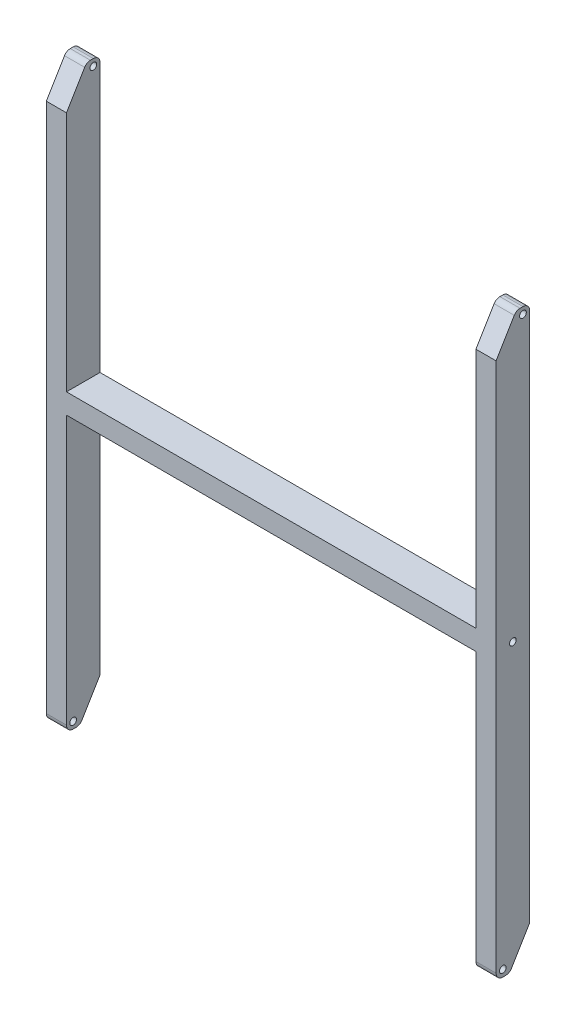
ISO-10303-21;
HEADER;
FILE_DESCRIPTION(('STEP AP214'),'2;1');
FILE_NAME('part.step','',(''),(''),'','','');
FILE_SCHEMA(('AUTOMOTIVE_DESIGN { 1 0 10303 214 1 1 1 1 }'));
ENDSEC;
DATA;
#1=APPLICATION_CONTEXT('core data for automotive mechanical design processes');
#2=APPLICATION_PROTOCOL_DEFINITION('international standard','automotive_design',2000,#1);
#3=PRODUCT_CONTEXT('',#1,'mechanical');
#4=PRODUCT('Part','Part','',(#3));
#5=PRODUCT_RELATED_PRODUCT_CATEGORY('part','',(#4));
#6=PRODUCT_DEFINITION_FORMATION('','',#4);
#7=PRODUCT_DEFINITION_CONTEXT('part definition',#1,'design');
#8=PRODUCT_DEFINITION('design','',#6,#7);
#9=PRODUCT_DEFINITION_SHAPE('','',#8);
#10=(LENGTH_UNIT() NAMED_UNIT(*) SI_UNIT(.MILLI.,.METRE.));
#11=(NAMED_UNIT(*) PLANE_ANGLE_UNIT() SI_UNIT($,.RADIAN.));
#12=(NAMED_UNIT(*) SI_UNIT($,.STERADIAN.) SOLID_ANGLE_UNIT());
#13=UNCERTAINTY_MEASURE_WITH_UNIT(LENGTH_MEASURE(1.E-05),#10,'distance_accuracy_value','');
#14=(GEOMETRIC_REPRESENTATION_CONTEXT(3) GLOBAL_UNCERTAINTY_ASSIGNED_CONTEXT((#13)) GLOBAL_UNIT_ASSIGNED_CONTEXT((#10,
#11,#12)) REPRESENTATION_CONTEXT('',''));
#15=CARTESIAN_POINT('',(0.,0.,0.));
#16=DIRECTION('',(0.,0.,1.));
#17=DIRECTION('',(1.,0.,0.));
#18=AXIS2_PLACEMENT_3D('',#15,#16,#17);
#19=CARTESIAN_POINT('',(0.,30.,50.));
#20=DIRECTION('',(0.,1.,0.));
#21=DIRECTION('',(0.,0.,1.));
#22=AXIS2_PLACEMENT_3D('',#19,#20,#21);
#23=PLANE('',#22);
#24=DIRECTION('',(0.,0.,-1.));
#25=VECTOR('',#24,1.);
#26=CARTESIAN_POINT('',(610.,30.,50.));
#27=LINE('',#26,#25);
#28=CARTESIAN_POINT('',(610.,30.,50.));
#29=VERTEX_POINT('',#28);
#30=CARTESIAN_POINT('',(610.,30.,-50.));
#31=VERTEX_POINT('',#30);
#32=EDGE_CURVE('E244',#29,#31,#27,.T.);
#33=ORIENTED_EDGE('',*,*,#32,.T.);
#34=DIRECTION('',(1.,0.,0.));
#35=VECTOR('',#34,1.);
#36=CARTESIAN_POINT('',(0.,30.,-50.));
#37=LINE('',#36,#35);
#38=CARTESIAN_POINT('',(-610.,30.,-50.));
#39=VERTEX_POINT('',#38);
#40=EDGE_CURVE('E238',#39,#31,#37,.T.);
#41=ORIENTED_EDGE('',*,*,#40,.F.);
#42=DIRECTION('',(0.,0.,-1.));
#43=VECTOR('',#42,1.);
#44=CARTESIAN_POINT('',(-610.,30.,50.));
#45=LINE('',#44,#43);
#46=CARTESIAN_POINT('',(-610.,30.,50.));
#47=VERTEX_POINT('',#46);
#48=EDGE_CURVE('E241',#47,#39,#45,.T.);
#49=ORIENTED_EDGE('',*,*,#48,.F.);
#50=DIRECTION('',(1.,0.,0.));
#51=VECTOR('',#50,1.);
#52=CARTESIAN_POINT('',(0.,30.,50.));
#53=LINE('',#52,#51);
#54=EDGE_CURVE('E402',#47,#29,#53,.T.);
#55=ORIENTED_EDGE('',*,*,#54,.T.);
#56=EDGE_LOOP('',(#33,#41,#49,#55));
#57=FACE_BOUND('',#56,.T.);
#58=ADVANCED_FACE('F41',(#57),#23,.T.);
#59=CARTESIAN_POINT('',(-670.,0.,50.));
#60=DIRECTION('',(1.,0.,0.));
#61=DIRECTION('',(0.,0.,-1.));
#62=AXIS2_PLACEMENT_3D('',#59,#60,#61);
#63=PLANE('',#62);
#64=CARTESIAN_POINT('',(-670.,0.,0.));
#65=DIRECTION('',(1.,0.,0.));
#66=DIRECTION('',(0.,0.,-1.));
#67=AXIS2_PLACEMENT_3D('',#64,#65,#66);
#68=CIRCLE('',#67,10.);
#69=CARTESIAN_POINT('',(-670.,0.,-10.));
#70=VERTEX_POINT('',#69);
#71=EDGE_CURVE('E732',#70,#70,#68,.T.);
#72=ORIENTED_EDGE('',*,*,#71,.T.);
#73=EDGE_LOOP('',(#72));
#74=FACE_BOUND('',#73,.T.);
#75=DIRECTION('',(0.,-0.857492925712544,0.514495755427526));
#76=VECTOR('',#75,1.);
#77=CARTESIAN_POINT('',(-670.,750.,50.));
#78=LINE('',#77,#76);
#79=CARTESIAN_POINT('',(-670.,840.28991510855,-4.17394906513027));
#80=VERTEX_POINT('',#79);
#81=CARTESIAN_POINT('',(-670.,750.,50.));
#82=VERTEX_POINT('',#81);
#83=EDGE_CURVE('E376',#80,#82,#78,.T.);
#84=ORIENTED_EDGE('',*,*,#83,.F.);
#85=CARTESIAN_POINT('',(-670.,830.,-21.3238075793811));
#86=DIRECTION('',(1.,0.,0.));
#87=DIRECTION('',(0.,0.,-1.));
#88=AXIS2_PLACEMENT_3D('',#85,#86,#87);
#89=CIRCLE('',#88,20.);
#90=CARTESIAN_POINT('',(-670.,850.,-21.3238075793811));
#91=VERTEX_POINT('',#90);
#92=EDGE_CURVE('E270',#80,#91,#89,.F.);
#93=ORIENTED_EDGE('',*,*,#92,.T.);
#94=DIRECTION('',(0.,0.,1.));
#95=VECTOR('',#94,1.);
#96=CARTESIAN_POINT('',(-670.,850.,-9.99999999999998));
#97=LINE('',#96,#95);
#98=CARTESIAN_POINT('',(-670.,850.,-30.));
#99=VERTEX_POINT('',#98);
#100=EDGE_CURVE('E373',#99,#91,#97,.T.);
#101=ORIENTED_EDGE('',*,*,#100,.F.);
#102=CARTESIAN_POINT('',(-670.,830.,-30.));
#103=DIRECTION('',(1.,0.,0.));
#104=DIRECTION('',(0.,0.,-1.));
#105=AXIS2_PLACEMENT_3D('',#102,#103,#104);
#106=CIRCLE('',#105,20.);
#107=CARTESIAN_POINT('',(-670.,830.,-50.));
#108=VERTEX_POINT('',#107);
#109=EDGE_CURVE('E268',#99,#108,#106,.F.);
#110=ORIENTED_EDGE('',*,*,#109,.T.);
#111=DIRECTION('',(0.,-1.,0.));
#112=VECTOR('',#111,1.);
#113=CARTESIAN_POINT('',(-670.,0.,-50.));
#114=LINE('',#113,#112);
#115=CARTESIAN_POINT('',(-670.,-750.,-50.));
#116=VERTEX_POINT('',#115);
#117=EDGE_CURVE('E379',#108,#116,#114,.T.);
#118=ORIENTED_EDGE('',*,*,#117,.T.);
#119=DIRECTION('',(0.,0.857492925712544,-0.514495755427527));
#120=VECTOR('',#119,1.);
#121=CARTESIAN_POINT('',(-670.,-850.,9.99999999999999));
#122=LINE('',#121,#120);
#123=CARTESIAN_POINT('',(-670.,-840.289915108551,4.17394906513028));
#124=VERTEX_POINT('',#123);
#125=EDGE_CURVE('E360',#124,#116,#122,.T.);
#126=ORIENTED_EDGE('',*,*,#125,.F.);
#127=CARTESIAN_POINT('',(-670.,-830.,21.3238075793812));
#128=DIRECTION('',(1.,0.,0.));
#129=DIRECTION('',(0.,0.,-1.));
#130=AXIS2_PLACEMENT_3D('',#127,#128,#129);
#131=CIRCLE('',#130,20.);
#132=CARTESIAN_POINT('',(-670.,-850.,21.3238075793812));
#133=VERTEX_POINT('',#132);
#134=EDGE_CURVE('E266',#124,#133,#131,.F.);
#135=ORIENTED_EDGE('',*,*,#134,.T.);
#136=DIRECTION('',(0.,0.,-1.));
#137=VECTOR('',#136,1.);
#138=CARTESIAN_POINT('',(-670.,-850.,50.));
#139=LINE('',#138,#137);
#140=CARTESIAN_POINT('',(-670.,-850.,30.));
#141=VERTEX_POINT('',#140);
#142=EDGE_CURVE('E357',#141,#133,#139,.T.);
#143=ORIENTED_EDGE('',*,*,#142,.F.);
#144=CARTESIAN_POINT('',(-670.,-830.,30.));
#145=DIRECTION('',(1.,0.,0.));
#146=DIRECTION('',(0.,0.,-1.));
#147=AXIS2_PLACEMENT_3D('',#144,#145,#146);
#148=CIRCLE('',#147,20.);
#149=CARTESIAN_POINT('',(-670.,-830.,50.));
#150=VERTEX_POINT('',#149);
#151=EDGE_CURVE('E264',#141,#150,#148,.F.);
#152=ORIENTED_EDGE('',*,*,#151,.T.);
#153=DIRECTION('',(0.,-1.,0.));
#154=VECTOR('',#153,1.);
#155=CARTESIAN_POINT('',(-670.,0.,50.));
#156=LINE('',#155,#154);
#157=EDGE_CURVE('E386',#82,#150,#156,.T.);
#158=ORIENTED_EDGE('',*,*,#157,.F.);
#159=EDGE_LOOP('',(#84,#93,#101,#110,#118,#126,#135,#143,#152,#158));
#160=FACE_BOUND('',#159,.T.);
#161=CARTESIAN_POINT('',(-670.,830.,-30.));
#162=DIRECTION('',(1.,0.,0.));
#163=DIRECTION('',(0.,0.,-1.));
#164=AXIS2_PLACEMENT_3D('',#161,#162,#163);
#165=CIRCLE('',#164,10.);
#166=CARTESIAN_POINT('',(-670.,830.,-40.));
#167=VERTEX_POINT('',#166);
#168=EDGE_CURVE('E367',#167,#167,#165,.T.);
#169=ORIENTED_EDGE('',*,*,#168,.T.);
#170=EDGE_LOOP('',(#169));
#171=FACE_BOUND('',#170,.T.);
#172=CARTESIAN_POINT('',(-670.,-830.,30.));
#173=DIRECTION('',(1.,0.,0.));
#174=DIRECTION('',(0.,0.,-1.));
#175=AXIS2_PLACEMENT_3D('',#172,#173,#174);
#176=CIRCLE('',#175,10.);
#177=CARTESIAN_POINT('',(-670.,-830.,20.));
#178=VERTEX_POINT('',#177);
#179=EDGE_CURVE('E351',#178,#178,#176,.T.);
#180=ORIENTED_EDGE('',*,*,#179,.T.);
#181=EDGE_LOOP('',(#180));
#182=FACE_BOUND('',#181,.T.);
#183=ADVANCED_FACE('F434',(#74,#160,#171,#182),#63,.F.);
#184=CARTESIAN_POINT('',(-610.,0.,50.));
#185=DIRECTION('',(1.,0.,0.));
#186=DIRECTION('',(0.,1.,0.));
#187=AXIS2_PLACEMENT_3D('',#184,#185,#186);
#188=PLANE('',#187);
#189=DIRECTION('',(0.,0.,-1.));
#190=VECTOR('',#189,1.);
#191=CARTESIAN_POINT('',(-610.,-850.,50.));
#192=LINE('',#191,#190);
#193=CARTESIAN_POINT('',(-610.,-850.,30.));
#194=VERTEX_POINT('',#193);
#195=CARTESIAN_POINT('',(-610.,-850.,21.3238075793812));
#196=VERTEX_POINT('',#195);
#197=EDGE_CURVE('E354',#194,#196,#192,.T.);
#198=ORIENTED_EDGE('',*,*,#197,.T.);
#199=CARTESIAN_POINT('',(-610.,-830.,21.3238075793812));
#200=DIRECTION('',(1.,0.,0.));
#201=DIRECTION('',(0.,1.,0.));
#202=AXIS2_PLACEMENT_3D('',#199,#200,#201);
#203=CIRCLE('',#202,20.);
#204=CARTESIAN_POINT('',(-610.,-840.289915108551,4.17394906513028));
#205=VERTEX_POINT('',#204);
#206=EDGE_CURVE('E282',#196,#205,#203,.T.);
#207=ORIENTED_EDGE('',*,*,#206,.T.);
#208=DIRECTION('',(0.,0.857492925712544,-0.514495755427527));
#209=VECTOR('',#208,1.);
#210=CARTESIAN_POINT('',(-610.,-850.,9.99999999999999));
#211=LINE('',#210,#209);
#212=CARTESIAN_POINT('',(-610.,-750.,-50.));
#213=VERTEX_POINT('',#212);
#214=EDGE_CURVE('E361',#205,#213,#211,.T.);
#215=ORIENTED_EDGE('',*,*,#214,.T.);
#216=DIRECTION('',(0.,-1.,0.));
#217=VECTOR('',#216,1.);
#218=CARTESIAN_POINT('',(-610.,0.,-50.));
#219=LINE('',#218,#217);
#220=CARTESIAN_POINT('',(-610.,-30.,-50.));
#221=VERTEX_POINT('',#220);
#222=EDGE_CURVE('E409',#221,#213,#219,.T.);
#223=ORIENTED_EDGE('',*,*,#222,.F.);
#224=DIRECTION('',(0.,0.,-1.));
#225=VECTOR('',#224,1.);
#226=CARTESIAN_POINT('',(-610.,-30.,50.));
#227=LINE('',#226,#225);
#228=CARTESIAN_POINT('',(-610.,-30.,50.));
#229=VERTEX_POINT('',#228);
#230=EDGE_CURVE('E251',#229,#221,#227,.T.);
#231=ORIENTED_EDGE('',*,*,#230,.F.);
#232=DIRECTION('',(0.,-1.,0.));
#233=VECTOR('',#232,1.);
#234=CARTESIAN_POINT('',(-610.,0.,50.));
#235=LINE('',#234,#233);
#236=CARTESIAN_POINT('',(-610.,-830.,50.));
#237=VERTEX_POINT('',#236);
#238=EDGE_CURVE('E389',#229,#237,#235,.T.);
#239=ORIENTED_EDGE('',*,*,#238,.T.);
#240=CARTESIAN_POINT('',(-610.,-830.,30.));
#241=DIRECTION('',(1.,0.,0.));
#242=DIRECTION('',(0.,1.,0.));
#243=AXIS2_PLACEMENT_3D('',#240,#241,#242);
#244=CIRCLE('',#243,20.);
#245=EDGE_CURVE('E280',#237,#194,#244,.T.);
#246=ORIENTED_EDGE('',*,*,#245,.T.);
#247=EDGE_LOOP('',(#198,#207,#215,#223,#231,#239,#246));
#248=FACE_BOUND('',#247,.T.);
#249=CARTESIAN_POINT('',(-610.,-830.,30.));
#250=DIRECTION('',(1.,0.,0.));
#251=DIRECTION('',(0.,0.,-1.));
#252=AXIS2_PLACEMENT_3D('',#249,#250,#251);
#253=CIRCLE('',#252,10.);
#254=CARTESIAN_POINT('',(-610.,-830.,20.));
#255=VERTEX_POINT('',#254);
#256=EDGE_CURVE('E347',#255,#255,#253,.T.);
#257=ORIENTED_EDGE('',*,*,#256,.F.);
#258=EDGE_LOOP('',(#257));
#259=FACE_BOUND('',#258,.T.);
#260=ADVANCED_FACE('F440',(#248,#259),#188,.T.);
#261=CARTESIAN_POINT('',(0.,-30.,50.));
#262=DIRECTION('',(0.,1.,0.));
#263=DIRECTION('',(0.,0.,1.));
#264=AXIS2_PLACEMENT_3D('',#261,#262,#263);
#265=PLANE('',#264);
#266=DIRECTION('',(1.,0.,0.));
#267=VECTOR('',#266,1.);
#268=CARTESIAN_POINT('',(0.,-30.,-50.));
#269=LINE('',#268,#267);
#270=CARTESIAN_POINT('',(610.,-30.,-50.));
#271=VERTEX_POINT('',#270);
#272=EDGE_CURVE('E234',#221,#271,#269,.T.);
#273=ORIENTED_EDGE('',*,*,#272,.T.);
#274=DIRECTION('',(0.,0.,-1.));
#275=VECTOR('',#274,1.);
#276=CARTESIAN_POINT('',(610.,-30.,50.));
#277=LINE('',#276,#275);
#278=CARTESIAN_POINT('',(610.,-30.,50.));
#279=VERTEX_POINT('',#278);
#280=EDGE_CURVE('E248',#279,#271,#277,.T.);
#281=ORIENTED_EDGE('',*,*,#280,.F.);
#282=DIRECTION('',(1.,0.,0.));
#283=VECTOR('',#282,1.);
#284=CARTESIAN_POINT('',(0.,-30.,50.));
#285=LINE('',#284,#283);
#286=EDGE_CURVE('E392',#229,#279,#285,.T.);
#287=ORIENTED_EDGE('',*,*,#286,.F.);
#288=ORIENTED_EDGE('',*,*,#230,.T.);
#289=EDGE_LOOP('',(#273,#281,#287,#288));
#290=FACE_BOUND('',#289,.T.);
#291=ADVANCED_FACE('F414',(#290),#265,.F.);
#292=CARTESIAN_POINT('',(609.999999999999,0.,50.));
#293=DIRECTION('',(1.,0.,0.));
#294=DIRECTION('',(0.,1.,0.));
#295=AXIS2_PLACEMENT_3D('',#292,#293,#294);
#296=PLANE('',#295);
#297=DIRECTION('',(0.,0.857492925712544,-0.514495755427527));
#298=VECTOR('',#297,1.);
#299=CARTESIAN_POINT('',(610.,-850.,9.99999999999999));
#300=LINE('',#299,#298);
#301=CARTESIAN_POINT('',(610.,-840.289915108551,4.17394906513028));
#302=VERTEX_POINT('',#301);
#303=CARTESIAN_POINT('',(610.,-750.,-50.));
#304=VERTEX_POINT('',#303);
#305=EDGE_CURVE('E230',#302,#304,#300,.T.);
#306=ORIENTED_EDGE('',*,*,#305,.F.);
#307=CARTESIAN_POINT('',(610.,-830.,21.3238075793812));
#308=DIRECTION('',(1.,0.,0.));
#309=DIRECTION('',(0.,1.,0.));
#310=AXIS2_PLACEMENT_3D('',#307,#308,#309);
#311=CIRCLE('',#310,20.);
#312=CARTESIAN_POINT('',(610.,-850.,21.3238075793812));
#313=VERTEX_POINT('',#312);
#314=EDGE_CURVE('E63',#302,#313,#311,.F.);
#315=ORIENTED_EDGE('',*,*,#314,.T.);
#316=DIRECTION('',(0.,0.,-1.));
#317=VECTOR('',#316,1.);
#318=CARTESIAN_POINT('',(610.,-850.,50.));
#319=LINE('',#318,#317);
#320=CARTESIAN_POINT('',(610.,-850.,30.));
#321=VERTEX_POINT('',#320);
#322=EDGE_CURVE('E217',#321,#313,#319,.T.);
#323=ORIENTED_EDGE('',*,*,#322,.F.);
#324=CARTESIAN_POINT('',(610.,-830.,30.));
#325=DIRECTION('',(1.,0.,0.));
#326=DIRECTION('',(0.,1.,0.));
#327=AXIS2_PLACEMENT_3D('',#324,#325,#326);
#328=CIRCLE('',#327,20.);
#329=CARTESIAN_POINT('',(610.,-830.,50.));
#330=VERTEX_POINT('',#329);
#331=EDGE_CURVE('E57',#321,#330,#328,.F.);
#332=ORIENTED_EDGE('',*,*,#331,.T.);
#333=DIRECTION('',(0.,-1.,0.));
#334=VECTOR('',#333,1.);
#335=CARTESIAN_POINT('',(609.999999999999,0.,50.));
#336=LINE('',#335,#334);
#337=EDGE_CURVE('E394',#279,#330,#336,.T.);
#338=ORIENTED_EDGE('',*,*,#337,.F.);
#339=ORIENTED_EDGE('',*,*,#280,.T.);
#340=DIRECTION('',(0.,-1.,0.));
#341=VECTOR('',#340,1.);
#342=CARTESIAN_POINT('',(609.999999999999,0.,-50.));
#343=LINE('',#342,#341);
#344=EDGE_CURVE('E232',#271,#304,#343,.T.);
#345=ORIENTED_EDGE('',*,*,#344,.T.);
#346=EDGE_LOOP('',(#306,#315,#323,#332,#338,#339,#345));
#347=FACE_BOUND('',#346,.T.);
#348=CARTESIAN_POINT('',(610.,-830.,30.));
#349=DIRECTION('',(1.,0.,0.));
#350=DIRECTION('',(0.,0.,-1.));
#351=AXIS2_PLACEMENT_3D('',#348,#349,#350);
#352=CIRCLE('',#351,10.);
#353=CARTESIAN_POINT('',(610.,-830.,20.));
#354=VERTEX_POINT('',#353);
#355=EDGE_CURVE('E333',#354,#354,#352,.T.);
#356=ORIENTED_EDGE('',*,*,#355,.T.);
#357=EDGE_LOOP('',(#356));
#358=FACE_BOUND('',#357,.T.);
#359=ADVANCED_FACE('F327',(#347,#358),#296,.F.);
#360=CARTESIAN_POINT('',(670.,0.,50.));
#361=DIRECTION('',(1.,0.,0.));
#362=DIRECTION('',(0.,1.,0.));
#363=AXIS2_PLACEMENT_3D('',#360,#361,#362);
#364=PLANE('',#363);
#365=CARTESIAN_POINT('',(670.,0.,0.));
#366=DIRECTION('',(1.,0.,0.));
#367=DIRECTION('',(0.,1.,0.));
#368=AXIS2_PLACEMENT_3D('',#365,#366,#367);
#369=CIRCLE('',#368,10.);
#370=CARTESIAN_POINT('',(669.999999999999,0.,-10.));
#371=VERTEX_POINT('',#370);
#372=EDGE_CURVE('E45',#371,#371,#369,.T.);
#373=ORIENTED_EDGE('',*,*,#372,.F.);
#374=EDGE_LOOP('',(#373));
#375=FACE_BOUND('',#374,.T.);
#376=DIRECTION('',(0.,0.,1.));
#377=VECTOR('',#376,1.);
#378=CARTESIAN_POINT('',(670.,850.,-9.99999999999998));
#379=LINE('',#378,#377);
#380=CARTESIAN_POINT('',(670.,850.,-30.));
#381=VERTEX_POINT('',#380);
#382=CARTESIAN_POINT('',(670.,850.,-21.3238075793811));
#383=VERTEX_POINT('',#382);
#384=EDGE_CURVE('E344',#381,#383,#379,.T.);
#385=ORIENTED_EDGE('',*,*,#384,.T.);
#386=CARTESIAN_POINT('',(670.,830.,-21.3238075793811));
#387=DIRECTION('',(1.,0.,0.));
#388=DIRECTION('',(0.,1.,0.));
#389=AXIS2_PLACEMENT_3D('',#386,#387,#388);
#390=CIRCLE('',#389,20.);
#391=CARTESIAN_POINT('',(670.,840.28991510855,-4.17394906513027));
#392=VERTEX_POINT('',#391);
#393=EDGE_CURVE('E306',#383,#392,#390,.T.);
#394=ORIENTED_EDGE('',*,*,#393,.T.);
#395=DIRECTION('',(0.,-0.857492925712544,0.514495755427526));
#396=VECTOR('',#395,1.);
#397=CARTESIAN_POINT('',(670.,750.,50.));
#398=LINE('',#397,#396);
#399=CARTESIAN_POINT('',(670.,750.,50.));
#400=VERTEX_POINT('',#399);
#401=EDGE_CURVE('E342',#392,#400,#398,.T.);
#402=ORIENTED_EDGE('',*,*,#401,.T.);
#403=DIRECTION('',(0.,-1.,0.));
#404=VECTOR('',#403,1.);
#405=CARTESIAN_POINT('',(670.,0.,50.));
#406=LINE('',#405,#404);
#407=CARTESIAN_POINT('',(670.,-830.,50.));
#408=VERTEX_POINT('',#407);
#409=EDGE_CURVE('E396',#400,#408,#406,.T.);
#410=ORIENTED_EDGE('',*,*,#409,.T.);
#411=CARTESIAN_POINT('',(670.,-830.,30.));
#412=DIRECTION('',(1.,0.,0.));
#413=DIRECTION('',(0.,1.,0.));
#414=AXIS2_PLACEMENT_3D('',#411,#412,#413);
#415=CIRCLE('',#414,20.);
#416=CARTESIAN_POINT('',(670.,-850.,30.));
#417=VERTEX_POINT('',#416);
#418=EDGE_CURVE('E301',#408,#417,#415,.T.);
#419=ORIENTED_EDGE('',*,*,#418,.T.);
#420=DIRECTION('',(0.,0.,-1.));
#421=VECTOR('',#420,1.);
#422=CARTESIAN_POINT('',(670.,-850.,50.));
#423=LINE('',#422,#421);
#424=CARTESIAN_POINT('',(670.,-850.,21.3238075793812));
#425=VERTEX_POINT('',#424);
#426=EDGE_CURVE('E216',#417,#425,#423,.T.);
#427=ORIENTED_EDGE('',*,*,#426,.T.);
#428=CARTESIAN_POINT('',(670.,-830.,21.3238075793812));
#429=DIRECTION('',(1.,0.,0.));
#430=DIRECTION('',(0.,1.,0.));
#431=AXIS2_PLACEMENT_3D('',#428,#429,#430);
#432=CIRCLE('',#431,20.);
#433=CARTESIAN_POINT('',(670.,-840.289915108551,4.17394906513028));
#434=VERTEX_POINT('',#433);
#435=EDGE_CURVE('E211',#425,#434,#432,.T.);
#436=ORIENTED_EDGE('',*,*,#435,.T.);
#437=DIRECTION('',(0.,0.857492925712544,-0.514495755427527));
#438=VECTOR('',#437,1.);
#439=CARTESIAN_POINT('',(670.,-850.,9.99999999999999));
#440=LINE('',#439,#438);
#441=CARTESIAN_POINT('',(670.,-750.,-50.));
#442=VERTEX_POINT('',#441);
#443=EDGE_CURVE('E202',#434,#442,#440,.T.);
#444=ORIENTED_EDGE('',*,*,#443,.T.);
#445=DIRECTION('',(0.,-1.,0.));
#446=VECTOR('',#445,1.);
#447=CARTESIAN_POINT('',(670.,0.,-50.));
#448=LINE('',#447,#446);
#449=CARTESIAN_POINT('',(670.,830.,-50.));
#450=VERTEX_POINT('',#449);
#451=EDGE_CURVE('E207',#450,#442,#448,.T.);
#452=ORIENTED_EDGE('',*,*,#451,.F.);
#453=CARTESIAN_POINT('',(670.,830.,-30.));
#454=DIRECTION('',(1.,0.,0.));
#455=DIRECTION('',(0.,1.,0.));
#456=AXIS2_PLACEMENT_3D('',#453,#454,#455);
#457=CIRCLE('',#456,20.);
#458=EDGE_CURVE('E304',#450,#381,#457,.T.);
#459=ORIENTED_EDGE('',*,*,#458,.T.);
#460=EDGE_LOOP('',(#385,#394,#402,#410,#419,#427,#436,#444,#452,#459));
#461=FACE_BOUND('',#460,.T.);
#462=CARTESIAN_POINT('',(670.,830.,-30.));
#463=DIRECTION('',(1.,0.,0.));
#464=DIRECTION('',(0.,0.,-1.));
#465=AXIS2_PLACEMENT_3D('',#462,#463,#464);
#466=CIRCLE('',#465,10.);
#467=CARTESIAN_POINT('',(670.,830.,-40.));
#468=VERTEX_POINT('',#467);
#469=EDGE_CURVE('E336',#468,#468,#466,.T.);
#470=ORIENTED_EDGE('',*,*,#469,.F.);
#471=EDGE_LOOP('',(#470));
#472=FACE_BOUND('',#471,.T.);
#473=CARTESIAN_POINT('',(670.,-830.,30.));
#474=DIRECTION('',(1.,0.,0.));
#475=DIRECTION('',(0.,0.,-1.));
#476=AXIS2_PLACEMENT_3D('',#473,#474,#475);
#477=CIRCLE('',#476,10.);
#478=CARTESIAN_POINT('',(670.,-830.,20.));
#479=VERTEX_POINT('',#478);
#480=EDGE_CURVE('E329',#479,#479,#477,.T.);
#481=ORIENTED_EDGE('',*,*,#480,.F.);
#482=EDGE_LOOP('',(#481));
#483=FACE_BOUND('',#482,.T.);
#484=ADVANCED_FACE('F205',(#375,#461,#472,#483),#364,.T.);
#485=DIRECTION('',(0.,-0.857492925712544,0.514495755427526));
#486=VECTOR('',#485,1.);
#487=CARTESIAN_POINT('',(610.,750.,50.));
#488=LINE('',#487,#486);
#489=CARTESIAN_POINT('',(610.,840.28991510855,-4.17394906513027));
#490=VERTEX_POINT('',#489);
#491=CARTESIAN_POINT('',(610.,750.,50.));
#492=VERTEX_POINT('',#491);
#493=EDGE_CURVE('E339',#490,#492,#488,.T.);
#494=ORIENTED_EDGE('',*,*,#493,.F.);
#495=CARTESIAN_POINT('',(609.999999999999,830.,-21.3238075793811));
#496=DIRECTION('',(1.,0.,0.));
#497=DIRECTION('',(0.,1.,0.));
#498=AXIS2_PLACEMENT_3D('',#495,#496,#497);
#499=CIRCLE('',#498,20.);
#500=CARTESIAN_POINT('',(610.,850.,-21.3238075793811));
#501=VERTEX_POINT('',#500);
#502=EDGE_CURVE('E294',#490,#501,#499,.F.);
#503=ORIENTED_EDGE('',*,*,#502,.T.);
#504=DIRECTION('',(0.,0.,1.));
#505=VECTOR('',#504,1.);
#506=CARTESIAN_POINT('',(610.,850.,-9.99999999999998));
#507=LINE('',#506,#505);
#508=CARTESIAN_POINT('',(610.,850.,-30.));
#509=VERTEX_POINT('',#508);
#510=EDGE_CURVE('E345',#509,#501,#507,.T.);
#511=ORIENTED_EDGE('',*,*,#510,.F.);
#512=CARTESIAN_POINT('',(609.999999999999,830.,-30.));
#513=DIRECTION('',(1.,0.,0.));
#514=DIRECTION('',(0.,1.,0.));
#515=AXIS2_PLACEMENT_3D('',#512,#513,#514);
#516=CIRCLE('',#515,20.);
#517=CARTESIAN_POINT('',(609.999999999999,830.,-50.));
#518=VERTEX_POINT('',#517);
#519=EDGE_CURVE('E292',#509,#518,#516,.F.);
#520=ORIENTED_EDGE('',*,*,#519,.T.);
#521=EDGE_CURVE('E227',#518,#31,#343,.T.);
#522=ORIENTED_EDGE('',*,*,#521,.T.);
#523=ORIENTED_EDGE('',*,*,#32,.F.);
#524=EDGE_CURVE('E397',#492,#29,#336,.T.);
#525=ORIENTED_EDGE('',*,*,#524,.F.);
#526=EDGE_LOOP('',(#494,#503,#511,#520,#522,#523,#525));
#527=FACE_BOUND('',#526,.T.);
#528=CARTESIAN_POINT('',(610.,830.,-30.));
#529=DIRECTION('',(1.,0.,0.));
#530=DIRECTION('',(0.,0.,-1.));
#531=AXIS2_PLACEMENT_3D('',#528,#529,#530);
#532=CIRCLE('',#531,10.);
#533=CARTESIAN_POINT('',(610.,830.,-40.));
#534=VERTEX_POINT('',#533);
#535=EDGE_CURVE('E324',#534,#534,#532,.T.);
#536=ORIENTED_EDGE('',*,*,#535,.T.);
#537=EDGE_LOOP('',(#536));
#538=FACE_BOUND('',#537,.T.);
#539=ADVANCED_FACE('F447',(#527,#538),#296,.F.);
#540=DIRECTION('',(0.,0.,1.));
#541=VECTOR('',#540,1.);
#542=CARTESIAN_POINT('',(-610.,850.,-9.99999999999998));
#543=LINE('',#542,#541);
#544=CARTESIAN_POINT('',(-610.,850.,-30.));
#545=VERTEX_POINT('',#544);
#546=CARTESIAN_POINT('',(-610.,850.,-21.3238075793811));
#547=VERTEX_POINT('',#546);
#548=EDGE_CURVE('E370',#545,#547,#543,.T.);
#549=ORIENTED_EDGE('',*,*,#548,.T.);
#550=CARTESIAN_POINT('',(-610.,830.,-21.3238075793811));
#551=DIRECTION('',(1.,0.,0.));
#552=DIRECTION('',(0.,1.,0.));
#553=AXIS2_PLACEMENT_3D('',#550,#551,#552);
#554=CIRCLE('',#553,20.);
#555=CARTESIAN_POINT('',(-610.,840.28991510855,-4.17394906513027));
#556=VERTEX_POINT('',#555);
#557=EDGE_CURVE('E260',#547,#556,#554,.T.);
#558=ORIENTED_EDGE('',*,*,#557,.T.);
#559=DIRECTION('',(0.,-0.857492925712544,0.514495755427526));
#560=VECTOR('',#559,1.);
#561=CARTESIAN_POINT('',(-610.,750.,50.));
#562=LINE('',#561,#560);
#563=CARTESIAN_POINT('',(-610.,750.,50.));
#564=VERTEX_POINT('',#563);
#565=EDGE_CURVE('E377',#556,#564,#562,.T.);
#566=ORIENTED_EDGE('',*,*,#565,.T.);
#567=EDGE_CURVE('E245',#564,#47,#235,.T.);
#568=ORIENTED_EDGE('',*,*,#567,.T.);
#569=ORIENTED_EDGE('',*,*,#48,.T.);
#570=CARTESIAN_POINT('',(-610.,830.,-50.));
#571=VERTEX_POINT('',#570);
#572=EDGE_CURVE('E240',#571,#39,#219,.T.);
#573=ORIENTED_EDGE('',*,*,#572,.F.);
#574=CARTESIAN_POINT('',(-610.,830.,-30.));
#575=DIRECTION('',(1.,0.,0.));
#576=DIRECTION('',(0.,1.,0.));
#577=AXIS2_PLACEMENT_3D('',#574,#575,#576);
#578=CIRCLE('',#577,20.);
#579=EDGE_CURVE('E258',#571,#545,#578,.T.);
#580=ORIENTED_EDGE('',*,*,#579,.T.);
#581=EDGE_LOOP('',(#549,#558,#566,#568,#569,#573,#580));
#582=FACE_BOUND('',#581,.T.);
#583=CARTESIAN_POINT('',(-610.,830.,-30.));
#584=DIRECTION('',(1.,0.,0.));
#585=DIRECTION('',(0.,0.,-1.));
#586=AXIS2_PLACEMENT_3D('',#583,#584,#585);
#587=CIRCLE('',#586,10.);
#588=CARTESIAN_POINT('',(-610.,830.,-40.));
#589=VERTEX_POINT('',#588);
#590=EDGE_CURVE('E363',#589,#589,#587,.T.);
#591=ORIENTED_EDGE('',*,*,#590,.F.);
#592=EDGE_LOOP('',(#591));
#593=FACE_BOUND('',#592,.T.);
#594=ADVANCED_FACE('F445',(#582,#593),#188,.T.);
#595=CARTESIAN_POINT('',(0.,0.,50.));
#596=DIRECTION('',(0.,0.,1.));
#597=DIRECTION('',(1.,0.,0.));
#598=AXIS2_PLACEMENT_3D('',#595,#596,#597);
#599=PLANE('',#598);
#600=ORIENTED_EDGE('',*,*,#337,.T.);
#601=DIRECTION('',(-1.,0.,0.));
#602=VECTOR('',#601,1.);
#603=CARTESIAN_POINT('',(670.,-830.,50.));
#604=LINE('',#603,#602);
#605=EDGE_CURVE('E11',#330,#408,#604,.F.);
#606=ORIENTED_EDGE('',*,*,#605,.T.);
#607=ORIENTED_EDGE('',*,*,#409,.F.);
#608=DIRECTION('',(1.,0.,0.));
#609=VECTOR('',#608,1.);
#610=CARTESIAN_POINT('',(2.77555756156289E-12,750.000000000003,50.));
#611=LINE('',#610,#609);
#612=EDGE_CURVE('E399',#492,#400,#611,.T.);
#613=ORIENTED_EDGE('',*,*,#612,.F.);
#614=ORIENTED_EDGE('',*,*,#524,.T.);
#615=ORIENTED_EDGE('',*,*,#54,.F.);
#616=ORIENTED_EDGE('',*,*,#567,.F.);
#617=DIRECTION('',(-1.,0.,0.));
#618=VECTOR('',#617,1.);
#619=CARTESIAN_POINT('',(-2.7755575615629E-12,750.000000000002,50.));
#620=LINE('',#619,#618);
#621=EDGE_CURVE('E383',#564,#82,#620,.T.);
#622=ORIENTED_EDGE('',*,*,#621,.T.);
#623=ORIENTED_EDGE('',*,*,#157,.T.);
#624=DIRECTION('',(1.,0.,0.));
#625=VECTOR('',#624,1.);
#626=CARTESIAN_POINT('',(0.,-830.,50.));
#627=LINE('',#626,#625);
#628=EDGE_CURVE('E286',#150,#237,#627,.T.);
#629=ORIENTED_EDGE('',*,*,#628,.T.);
#630=ORIENTED_EDGE('',*,*,#238,.F.);
#631=ORIENTED_EDGE('',*,*,#286,.T.);
#632=EDGE_LOOP('',(#600,#606,#607,#613,#614,#615,#616,#622,#623,#629,#630,#631));
#633=FACE_BOUND('',#632,.T.);
#634=ADVANCED_FACE('F419',(#633),#599,.T.);
#635=CARTESIAN_POINT('',(0.,0.,-50.));
#636=DIRECTION('',(0.,0.,1.));
#637=DIRECTION('',(1.,0.,0.));
#638=AXIS2_PLACEMENT_3D('',#635,#636,#637);
#639=PLANE('',#638);
#640=ORIENTED_EDGE('',*,*,#521,.F.);
#641=DIRECTION('',(-1.,0.,0.));
#642=VECTOR('',#641,1.);
#643=CARTESIAN_POINT('',(0.,830.,-50.));
#644=LINE('',#643,#642);
#645=EDGE_CURVE('E226',#518,#450,#644,.F.);
#646=ORIENTED_EDGE('',*,*,#645,.T.);
#647=ORIENTED_EDGE('',*,*,#451,.T.);
#648=DIRECTION('',(1.,0.,0.));
#649=VECTOR('',#648,1.);
#650=CARTESIAN_POINT('',(2.77555756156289E-12,-750.000000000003,-50.));
#651=LINE('',#650,#649);
#652=EDGE_CURVE('E224',#304,#442,#651,.T.);
#653=ORIENTED_EDGE('',*,*,#652,.F.);
#654=ORIENTED_EDGE('',*,*,#344,.F.);
#655=ORIENTED_EDGE('',*,*,#272,.F.);
#656=ORIENTED_EDGE('',*,*,#222,.T.);
#657=DIRECTION('',(-1.,0.,0.));
#658=VECTOR('',#657,1.);
#659=CARTESIAN_POINT('',(-2.77555756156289E-12,-750.000000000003,-50.));
#660=LINE('',#659,#658);
#661=EDGE_CURVE('E406',#213,#116,#660,.T.);
#662=ORIENTED_EDGE('',*,*,#661,.T.);
#663=ORIENTED_EDGE('',*,*,#117,.F.);
#664=DIRECTION('',(1.,0.,0.));
#665=VECTOR('',#664,1.);
#666=CARTESIAN_POINT('',(-610.,830.,-50.));
#667=LINE('',#666,#665);
#668=EDGE_CURVE('E272',#108,#571,#667,.T.);
#669=ORIENTED_EDGE('',*,*,#668,.T.);
#670=ORIENTED_EDGE('',*,*,#572,.T.);
#671=ORIENTED_EDGE('',*,*,#40,.T.);
#672=EDGE_LOOP('',(#640,#646,#647,#653,#654,#655,#656,#662,#663,#669,#670,#671));
#673=FACE_BOUND('',#672,.T.);
#674=ADVANCED_FACE('F222',(#673),#639,.F.);
#675=CARTESIAN_POINT('',(-670.,750.,50.));
#676=DIRECTION('',(0.,0.514495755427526,0.857492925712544));
#677=DIRECTION('',(0.,-0.857492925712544,0.514495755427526));
#678=AXIS2_PLACEMENT_3D('',#675,#676,#677);
#679=PLANE('',#678);
#680=ORIENTED_EDGE('',*,*,#565,.F.);
#681=DIRECTION('',(1.,0.,0.));
#682=VECTOR('',#681,1.);
#683=CARTESIAN_POINT('',(-670.,840.28991510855,-4.17394906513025));
#684=LINE('',#683,#682);
#685=EDGE_CURVE('E262',#556,#80,#684,.F.);
#686=ORIENTED_EDGE('',*,*,#685,.T.);
#687=ORIENTED_EDGE('',*,*,#83,.T.);
#688=ORIENTED_EDGE('',*,*,#621,.F.);
#689=EDGE_LOOP('',(#680,#686,#687,#688));
#690=FACE_BOUND('',#689,.T.);
#691=ADVANCED_FACE('F510',(#690),#679,.T.);
#692=CARTESIAN_POINT('',(-670.,850.,-9.99999999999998));
#693=DIRECTION('',(0.,1.,0.));
#694=DIRECTION('',(0.,0.,1.));
#695=AXIS2_PLACEMENT_3D('',#692,#693,#694);
#696=PLANE('',#695);
#697=ORIENTED_EDGE('',*,*,#100,.T.);
#698=DIRECTION('',(1.,0.,0.));
#699=VECTOR('',#698,1.);
#700=CARTESIAN_POINT('',(-670.,850.,-21.3238075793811));
#701=LINE('',#700,#699);
#702=EDGE_CURVE('E255',#91,#547,#701,.T.);
#703=ORIENTED_EDGE('',*,*,#702,.T.);
#704=ORIENTED_EDGE('',*,*,#548,.F.);
#705=DIRECTION('',(1.,0.,0.));
#706=VECTOR('',#705,1.);
#707=CARTESIAN_POINT('',(-670.,850.,-30.));
#708=LINE('',#707,#706);
#709=EDGE_CURVE('E253',#545,#99,#708,.F.);
#710=ORIENTED_EDGE('',*,*,#709,.T.);
#711=EDGE_LOOP('',(#697,#703,#704,#710));
#712=FACE_BOUND('',#711,.T.);
#713=ADVANCED_FACE('F540',(#712),#696,.T.);
#714=CARTESIAN_POINT('',(-670.,830.,-30.));
#715=DIRECTION('',(1.,0.,0.));
#716=DIRECTION('',(0.,0.,-1.));
#717=AXIS2_PLACEMENT_3D('',#714,#715,#716);
#718=CYLINDRICAL_SURFACE('',#717,10.);
#719=ORIENTED_EDGE('',*,*,#168,.F.);
#720=EDGE_LOOP('',(#719));
#721=FACE_BOUND('',#720,.T.);
#722=ORIENTED_EDGE('',*,*,#590,.T.);
#723=EDGE_LOOP('',(#722));
#724=FACE_BOUND('',#723,.T.);
#725=ADVANCED_FACE('F544',(#721,#724),#718,.F.);
#726=CARTESIAN_POINT('',(-670.,-850.,9.99999999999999));
#727=DIRECTION('',(0.,-0.514495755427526,-0.857492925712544));
#728=DIRECTION('',(0.,0.857492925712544,-0.514495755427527));
#729=AXIS2_PLACEMENT_3D('',#726,#727,#728);
#730=PLANE('',#729);
#731=ORIENTED_EDGE('',*,*,#214,.F.);
#732=DIRECTION('',(1.,0.,0.));
#733=VECTOR('',#732,1.);
#734=CARTESIAN_POINT('',(-670.,-840.289915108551,4.17394906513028));
#735=LINE('',#734,#733);
#736=EDGE_CURVE('E284',#205,#124,#735,.F.);
#737=ORIENTED_EDGE('',*,*,#736,.T.);
#738=ORIENTED_EDGE('',*,*,#125,.T.);
#739=ORIENTED_EDGE('',*,*,#661,.F.);
#740=EDGE_LOOP('',(#731,#737,#738,#739));
#741=FACE_BOUND('',#740,.T.);
#742=ADVANCED_FACE('F532',(#741),#730,.T.);
#743=CARTESIAN_POINT('',(-670.,-850.,50.));
#744=DIRECTION('',(0.,-1.,0.));
#745=DIRECTION('',(0.,0.,-1.));
#746=AXIS2_PLACEMENT_3D('',#743,#744,#745);
#747=PLANE('',#746);
#748=ORIENTED_EDGE('',*,*,#142,.T.);
#749=DIRECTION('',(1.,0.,0.));
#750=VECTOR('',#749,1.);
#751=CARTESIAN_POINT('',(-670.,-850.,21.3238075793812));
#752=LINE('',#751,#750);
#753=EDGE_CURVE('E277',#133,#196,#752,.T.);
#754=ORIENTED_EDGE('',*,*,#753,.T.);
#755=ORIENTED_EDGE('',*,*,#197,.F.);
#756=DIRECTION('',(1.,0.,0.));
#757=VECTOR('',#756,1.);
#758=CARTESIAN_POINT('',(-670.,-850.,30.));
#759=LINE('',#758,#757);
#760=EDGE_CURVE('E275',#194,#141,#759,.F.);
#761=ORIENTED_EDGE('',*,*,#760,.T.);
#762=EDGE_LOOP('',(#748,#754,#755,#761));
#763=FACE_BOUND('',#762,.T.);
#764=ADVANCED_FACE('F525',(#763),#747,.T.);
#765=CARTESIAN_POINT('',(-670.,-830.,30.));
#766=DIRECTION('',(1.,0.,0.));
#767=DIRECTION('',(0.,0.,-1.));
#768=AXIS2_PLACEMENT_3D('',#765,#766,#767);
#769=CYLINDRICAL_SURFACE('',#768,10.);
#770=ORIENTED_EDGE('',*,*,#179,.F.);
#771=EDGE_LOOP('',(#770));
#772=FACE_BOUND('',#771,.T.);
#773=ORIENTED_EDGE('',*,*,#256,.T.);
#774=EDGE_LOOP('',(#773));
#775=FACE_BOUND('',#774,.T.);
#776=ADVANCED_FACE('F460',(#772,#775),#769,.F.);
#777=CARTESIAN_POINT('',(-670.,830.,-21.3238075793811));
#778=DIRECTION('',(1.,0.,0.));
#779=DIRECTION('',(0.,0.,-1.));
#780=AXIS2_PLACEMENT_3D('',#777,#778,#779);
#781=CYLINDRICAL_SURFACE('',#780,20.);
#782=ORIENTED_EDGE('',*,*,#92,.F.);
#783=ORIENTED_EDGE('',*,*,#685,.F.);
#784=ORIENTED_EDGE('',*,*,#557,.F.);
#785=ORIENTED_EDGE('',*,*,#702,.F.);
#786=EDGE_LOOP('',(#782,#783,#784,#785));
#787=FACE_BOUND('',#786,.T.);
#788=ADVANCED_FACE('F456',(#787),#781,.T.);
#789=CARTESIAN_POINT('',(0.,830.,-30.));
#790=DIRECTION('',(-1.,0.,0.));
#791=DIRECTION('',(0.,0.,1.));
#792=AXIS2_PLACEMENT_3D('',#789,#790,#791);
#793=CYLINDRICAL_SURFACE('',#792,20.);
#794=ORIENTED_EDGE('',*,*,#109,.F.);
#795=ORIENTED_EDGE('',*,*,#709,.F.);
#796=ORIENTED_EDGE('',*,*,#579,.F.);
#797=ORIENTED_EDGE('',*,*,#668,.F.);
#798=EDGE_LOOP('',(#794,#795,#796,#797));
#799=FACE_BOUND('',#798,.T.);
#800=ADVANCED_FACE('F459',(#799),#793,.T.);
#801=CARTESIAN_POINT('',(-670.,-830.,21.3238075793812));
#802=DIRECTION('',(1.,0.,0.));
#803=DIRECTION('',(0.,0.,-1.));
#804=AXIS2_PLACEMENT_3D('',#801,#802,#803);
#805=CYLINDRICAL_SURFACE('',#804,20.);
#806=ORIENTED_EDGE('',*,*,#134,.F.);
#807=ORIENTED_EDGE('',*,*,#736,.F.);
#808=ORIENTED_EDGE('',*,*,#206,.F.);
#809=ORIENTED_EDGE('',*,*,#753,.F.);
#810=EDGE_LOOP('',(#806,#807,#808,#809));
#811=FACE_BOUND('',#810,.T.);
#812=ADVANCED_FACE('F464',(#811),#805,.T.);
#813=CARTESIAN_POINT('',(0.,-830.,30.));
#814=DIRECTION('',(1.,0.,0.));
#815=DIRECTION('',(0.,0.,-1.));
#816=AXIS2_PLACEMENT_3D('',#813,#814,#815);
#817=CYLINDRICAL_SURFACE('',#816,20.);
#818=ORIENTED_EDGE('',*,*,#151,.F.);
#819=ORIENTED_EDGE('',*,*,#760,.F.);
#820=ORIENTED_EDGE('',*,*,#245,.F.);
#821=ORIENTED_EDGE('',*,*,#628,.F.);
#822=EDGE_LOOP('',(#818,#819,#820,#821));
#823=FACE_BOUND('',#822,.T.);
#824=ADVANCED_FACE('F468',(#823),#817,.T.);
#825=CARTESIAN_POINT('',(670.,850.,-9.99999999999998));
#826=DIRECTION('',(0.,-1.,0.));
#827=DIRECTION('',(0.,0.,-1.));
#828=AXIS2_PLACEMENT_3D('',#825,#826,#827);
#829=PLANE('',#828);
#830=ORIENTED_EDGE('',*,*,#510,.T.);
#831=DIRECTION('',(-1.,0.,0.));
#832=VECTOR('',#831,1.);
#833=CARTESIAN_POINT('',(670.,850.,-21.3238075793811));
#834=LINE('',#833,#832);
#835=EDGE_CURVE('E299',#501,#383,#834,.F.);
#836=ORIENTED_EDGE('',*,*,#835,.T.);
#837=ORIENTED_EDGE('',*,*,#384,.F.);
#838=DIRECTION('',(-1.,0.,0.));
#839=VECTOR('',#838,1.);
#840=CARTESIAN_POINT('',(670.,850.,-30.));
#841=LINE('',#840,#839);
#842=EDGE_CURVE('E296',#381,#509,#841,.T.);
#843=ORIENTED_EDGE('',*,*,#842,.T.);
#844=EDGE_LOOP('',(#830,#836,#837,#843));
#845=FACE_BOUND('',#844,.T.);
#846=ADVANCED_FACE('F472',(#845),#829,.F.);
#847=CARTESIAN_POINT('',(670.,750.,50.));
#848=DIRECTION('',(0.,-0.514495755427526,-0.857492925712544));
#849=DIRECTION('',(0.,0.857492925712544,-0.514495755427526));
#850=AXIS2_PLACEMENT_3D('',#847,#848,#849);
#851=PLANE('',#850);
#852=ORIENTED_EDGE('',*,*,#401,.F.);
#853=DIRECTION('',(-1.,0.,0.));
#854=VECTOR('',#853,1.);
#855=CARTESIAN_POINT('',(670.,840.28991510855,-4.17394906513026));
#856=LINE('',#855,#854);
#857=EDGE_CURVE('E289',#392,#490,#856,.T.);
#858=ORIENTED_EDGE('',*,*,#857,.T.);
#859=ORIENTED_EDGE('',*,*,#493,.T.);
#860=ORIENTED_EDGE('',*,*,#612,.T.);
#861=EDGE_LOOP('',(#852,#858,#859,#860));
#862=FACE_BOUND('',#861,.T.);
#863=ADVANCED_FACE('F492',(#862),#851,.F.);
#864=CARTESIAN_POINT('',(670.,830.,-30.));
#865=DIRECTION('',(-1.,0.,0.));
#866=DIRECTION('',(0.,0.,1.));
#867=AXIS2_PLACEMENT_3D('',#864,#865,#866);
#868=CYLINDRICAL_SURFACE('',#867,10.);
#869=ORIENTED_EDGE('',*,*,#469,.T.);
#870=EDGE_LOOP('',(#869));
#871=FACE_BOUND('',#870,.T.);
#872=ORIENTED_EDGE('',*,*,#535,.F.);
#873=EDGE_LOOP('',(#872));
#874=FACE_BOUND('',#873,.T.);
#875=ADVANCED_FACE('F715',(#871,#874),#868,.F.);
#876=CARTESIAN_POINT('',(670.,-850.,50.));
#877=DIRECTION('',(0.,1.,0.));
#878=DIRECTION('',(0.,0.,1.));
#879=AXIS2_PLACEMENT_3D('',#876,#877,#878);
#880=PLANE('',#879);
#881=ORIENTED_EDGE('',*,*,#322,.T.);
#882=DIRECTION('',(-1.,0.,0.));
#883=VECTOR('',#882,1.);
#884=CARTESIAN_POINT('',(670.,-850.,21.3238075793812));
#885=LINE('',#884,#883);
#886=EDGE_CURVE('E50',#313,#425,#885,.F.);
#887=ORIENTED_EDGE('',*,*,#886,.T.);
#888=ORIENTED_EDGE('',*,*,#426,.F.);
#889=DIRECTION('',(-1.,0.,0.));
#890=VECTOR('',#889,1.);
#891=CARTESIAN_POINT('',(610.,-850.,30.));
#892=LINE('',#891,#890);
#893=EDGE_CURVE('E313',#417,#321,#892,.T.);
#894=ORIENTED_EDGE('',*,*,#893,.T.);
#895=EDGE_LOOP('',(#881,#887,#888,#894));
#896=FACE_BOUND('',#895,.T.);
#897=ADVANCED_FACE('F319',(#896),#880,.F.);
#898=CARTESIAN_POINT('',(670.,-850.,9.99999999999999));
#899=DIRECTION('',(0.,0.514495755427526,0.857492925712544));
#900=DIRECTION('',(0.,-0.857492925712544,0.514495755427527));
#901=AXIS2_PLACEMENT_3D('',#898,#899,#900);
#902=PLANE('',#901);
#903=ORIENTED_EDGE('',*,*,#443,.F.);
#904=DIRECTION('',(-1.,0.,0.));
#905=VECTOR('',#904,1.);
#906=CARTESIAN_POINT('',(670.,-840.289915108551,4.17394906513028));
#907=LINE('',#906,#905);
#908=EDGE_CURVE('E309',#434,#302,#907,.T.);
#909=ORIENTED_EDGE('',*,*,#908,.T.);
#910=ORIENTED_EDGE('',*,*,#305,.T.);
#911=ORIENTED_EDGE('',*,*,#652,.T.);
#912=EDGE_LOOP('',(#903,#909,#910,#911));
#913=FACE_BOUND('',#912,.T.);
#914=ADVANCED_FACE('F229',(#913),#902,.F.);
#915=CARTESIAN_POINT('',(670.,-830.,30.));
#916=DIRECTION('',(-1.,0.,0.));
#917=DIRECTION('',(0.,0.,1.));
#918=AXIS2_PLACEMENT_3D('',#915,#916,#917);
#919=CYLINDRICAL_SURFACE('',#918,10.);
#920=ORIENTED_EDGE('',*,*,#480,.T.);
#921=EDGE_LOOP('',(#920));
#922=FACE_BOUND('',#921,.T.);
#923=ORIENTED_EDGE('',*,*,#355,.F.);
#924=EDGE_LOOP('',(#923));
#925=FACE_BOUND('',#924,.T.);
#926=ADVANCED_FACE('F477',(#922,#925),#919,.F.);
#927=CARTESIAN_POINT('',(670.,830.,-21.3238075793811));
#928=DIRECTION('',(-1.,0.,0.));
#929=DIRECTION('',(0.,0.,1.));
#930=AXIS2_PLACEMENT_3D('',#927,#928,#929);
#931=CYLINDRICAL_SURFACE('',#930,20.);
#932=ORIENTED_EDGE('',*,*,#393,.F.);
#933=ORIENTED_EDGE('',*,*,#835,.F.);
#934=ORIENTED_EDGE('',*,*,#502,.F.);
#935=ORIENTED_EDGE('',*,*,#857,.F.);
#936=EDGE_LOOP('',(#932,#933,#934,#935));
#937=FACE_BOUND('',#936,.T.);
#938=ADVANCED_FACE('F474',(#937),#931,.T.);
#939=CARTESIAN_POINT('',(670.,830.,-30.));
#940=DIRECTION('',(-1.,0.,0.));
#941=DIRECTION('',(0.,0.,1.));
#942=AXIS2_PLACEMENT_3D('',#939,#940,#941);
#943=CYLINDRICAL_SURFACE('',#942,20.);
#944=ORIENTED_EDGE('',*,*,#458,.F.);
#945=ORIENTED_EDGE('',*,*,#645,.F.);
#946=ORIENTED_EDGE('',*,*,#519,.F.);
#947=ORIENTED_EDGE('',*,*,#842,.F.);
#948=EDGE_LOOP('',(#944,#945,#946,#947));
#949=FACE_BOUND('',#948,.T.);
#950=ADVANCED_FACE('F432',(#949),#943,.T.);
#951=CARTESIAN_POINT('',(670.,-830.,21.3238075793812));
#952=DIRECTION('',(-1.,0.,0.));
#953=DIRECTION('',(0.,0.,1.));
#954=AXIS2_PLACEMENT_3D('',#951,#952,#953);
#955=CYLINDRICAL_SURFACE('',#954,20.);
#956=ORIENTED_EDGE('',*,*,#435,.F.);
#957=ORIENTED_EDGE('',*,*,#886,.F.);
#958=ORIENTED_EDGE('',*,*,#314,.F.);
#959=ORIENTED_EDGE('',*,*,#908,.F.);
#960=EDGE_LOOP('',(#956,#957,#958,#959));
#961=FACE_BOUND('',#960,.T.);
#962=ADVANCED_FACE('F326',(#961),#955,.T.);
#963=CARTESIAN_POINT('',(670.,-830.,30.));
#964=DIRECTION('',(1.,0.,0.));
#965=DIRECTION('',(0.,0.,-1.));
#966=AXIS2_PLACEMENT_3D('',#963,#964,#965);
#967=CYLINDRICAL_SURFACE('',#966,20.);
#968=ORIENTED_EDGE('',*,*,#418,.F.);
#969=ORIENTED_EDGE('',*,*,#605,.F.);
#970=ORIENTED_EDGE('',*,*,#331,.F.);
#971=ORIENTED_EDGE('',*,*,#893,.F.);
#972=EDGE_LOOP('',(#968,#969,#970,#971));
#973=FACE_BOUND('',#972,.T.);
#974=ADVANCED_FACE('F43',(#973),#967,.T.);
#975=CARTESIAN_POINT('',(-750.,0.,0.));
#976=DIRECTION('',(1.,0.,0.));
#977=DIRECTION('',(0.,0.,-1.));
#978=AXIS2_PLACEMENT_3D('',#975,#976,#977);
#979=CYLINDRICAL_SURFACE('',#978,10.);
#980=CARTESIAN_POINT('',(669.999999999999,0.,-10.));
#981=CARTESIAN_POINT('',(656.041666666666,0.,-10.));
#982=CARTESIAN_POINT('',(642.083333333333,0.,-10.));
#983=CARTESIAN_POINT('',(614.166666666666,0.,-10.));
#984=CARTESIAN_POINT('',(600.208333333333,0.,-10.));
#985=CARTESIAN_POINT('',(572.291666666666,0.,-10.));
#986=CARTESIAN_POINT('',(558.333333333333,0.,-10.));
#987=CARTESIAN_POINT('',(530.416666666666,0.,-10.));
#988=CARTESIAN_POINT('',(516.458333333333,0.,-10.));
#989=CARTESIAN_POINT('',(488.541666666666,0.,-10.));
#990=CARTESIAN_POINT('',(474.583333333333,0.,-10.));
#991=CARTESIAN_POINT('',(446.666666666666,0.,-10.));
#992=CARTESIAN_POINT('',(432.708333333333,0.,-10.));
#993=CARTESIAN_POINT('',(404.791666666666,0.,-10.));
#994=CARTESIAN_POINT('',(390.833333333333,0.,-10.));
#995=CARTESIAN_POINT('',(362.916666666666,0.,-10.));
#996=CARTESIAN_POINT('',(348.958333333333,0.,-10.));
#997=CARTESIAN_POINT('',(321.041666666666,0.,-10.));
#998=CARTESIAN_POINT('',(307.083333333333,0.,-10.));
#999=CARTESIAN_POINT('',(279.166666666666,0.,-10.));
#1000=CARTESIAN_POINT('',(265.208333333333,0.,-10.));
#1001=CARTESIAN_POINT('',(237.291666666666,0.,-10.));
#1002=CARTESIAN_POINT('',(223.333333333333,0.,-10.));
#1003=CARTESIAN_POINT('',(195.416666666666,0.,-10.));
#1004=CARTESIAN_POINT('',(181.458333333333,0.,-10.));
#1005=CARTESIAN_POINT('',(153.541666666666,0.,-10.));
#1006=CARTESIAN_POINT('',(139.583333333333,0.,-10.));
#1007=CARTESIAN_POINT('',(111.666666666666,0.,-10.));
#1008=CARTESIAN_POINT('',(97.7083333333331,0.,-10.));
#1009=CARTESIAN_POINT('',(69.7916666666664,0.,-10.));
#1010=CARTESIAN_POINT('',(55.8333333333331,0.,-10.));
#1011=CARTESIAN_POINT('',(27.9166666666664,0.,-10.));
#1012=CARTESIAN_POINT('',(13.9583333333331,0.,-10.));
#1013=CARTESIAN_POINT('',(-13.9583333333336,0.,-10.));
#1014=CARTESIAN_POINT('',(-27.9166666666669,0.,-10.));
#1015=CARTESIAN_POINT('',(-55.8333333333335,0.,-10.));
#1016=CARTESIAN_POINT('',(-69.7916666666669,0.,-10.));
#1017=CARTESIAN_POINT('',(-97.7083333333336,0.,-10.));
#1018=CARTESIAN_POINT('',(-111.666666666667,0.,-10.));
#1019=CARTESIAN_POINT('',(-139.583333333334,0.,-10.));
#1020=CARTESIAN_POINT('',(-153.541666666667,0.,-10.));
#1021=CARTESIAN_POINT('',(-181.458333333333,0.,-10.));
#1022=CARTESIAN_POINT('',(-195.416666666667,0.,-10.));
#1023=CARTESIAN_POINT('',(-223.333333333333,0.,-10.));
#1024=CARTESIAN_POINT('',(-237.291666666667,0.,-10.));
#1025=CARTESIAN_POINT('',(-265.208333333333,0.,-10.));
#1026=CARTESIAN_POINT('',(-279.166666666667,0.,-10.));
#1027=CARTESIAN_POINT('',(-307.083333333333,0.,-10.));
#1028=CARTESIAN_POINT('',(-321.041666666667,0.,-10.));
#1029=CARTESIAN_POINT('',(-348.958333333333,0.,-10.));
#1030=CARTESIAN_POINT('',(-362.916666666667,0.,-10.));
#1031=CARTESIAN_POINT('',(-390.833333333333,0.,-10.));
#1032=CARTESIAN_POINT('',(-404.791666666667,0.,-10.));
#1033=CARTESIAN_POINT('',(-432.708333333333,0.,-10.));
#1034=CARTESIAN_POINT('',(-446.666666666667,0.,-10.));
#1035=CARTESIAN_POINT('',(-474.583333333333,0.,-10.));
#1036=CARTESIAN_POINT('',(-488.541666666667,0.,-10.));
#1037=CARTESIAN_POINT('',(-516.458333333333,0.,-10.));
#1038=CARTESIAN_POINT('',(-530.416666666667,0.,-10.));
#1039=CARTESIAN_POINT('',(-558.333333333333,0.,-10.));
#1040=CARTESIAN_POINT('',(-572.291666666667,0.,-10.));
#1041=CARTESIAN_POINT('',(-600.208333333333,0.,-10.));
#1042=CARTESIAN_POINT('',(-614.166666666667,0.,-10.));
#1043=CARTESIAN_POINT('',(-642.083333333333,0.,-10.));
#1044=CARTESIAN_POINT('',(-656.041666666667,0.,-10.));
#1045=CARTESIAN_POINT('',(-670.,0.,-10.));
#1046=B_SPLINE_CURVE_WITH_KNOTS('',3,(#980,#981,#982,#983,#984,#985,#986,#987,#988,#989,#990,
#991,#992,#993,#994,#995,#996,#997,#998,#999,#1000,#1001,#1002,#1003,#1004,#1005,#1006,#1007,
#1008,#1009,#1010,#1011,#1012,#1013,#1014,#1015,#1016,#1017,#1018,#1019,#1020,#1021,#1022,#1023,
#1024,#1025,#1026,#1027,#1028,#1029,#1030,#1031,#1032,#1033,#1034,#1035,#1036,#1037,#1038,#1039,
#1040,#1041,#1042,#1043,#1044,#1045),.UNSPECIFIED.,.F.,.F.,(4,2,2,2,2,2,2,2,2,2,2,2,2,2,2,2,2,2,
2,2,2,2,2,2,2,2,2,2,2,2,2,2,4),(0.,41.8749999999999,83.75,125.625,167.5,209.375,251.25,293.125,
335.,376.875,418.75,460.625,502.5,544.375,586.25,628.125,670.,711.875,753.75,795.625,837.5,
879.375,921.25,963.125,1005.,1046.875,1088.75,1130.625,1172.5,1214.375,1256.25,1298.125,1340.),.UNSPECIFIED.);
#1047=EDGE_CURVE('BSEAM424',#371,#70,#1046,.T.);
#1048=ORIENTED_EDGE('',*,*,#372,.T.);
#1049=ORIENTED_EDGE('',*,*,#71,.F.);
#1050=ORIENTED_EDGE('',*,*,#1047,.T.);
#1051=ORIENTED_EDGE('',*,*,#1047,.F.);
#1052=EDGE_LOOP('',(#1048,#1050,#1049,#1051));
#1053=FACE_BOUND('',#1052,.T.);
#1054=ADVANCED_FACE('F424',(#1053),#979,.F.);
#1055=CLOSED_SHELL('',(#58,#183,#260,#291,#359,#484,#539,#594,#634,#674,#691,#713,#725,#742,
#764,#776,#788,#800,#812,#824,#846,#863,#875,#897,#914,#926,#938,#950,#962,#974,#1054));
#1056=MANIFOLD_SOLID_BREP('B2',#1055);
#1057=ADVANCED_BREP_SHAPE_REPRESENTATION('',(#18,#1056),#14);
#1058=SHAPE_DEFINITION_REPRESENTATION(#9,#1057);
ENDSEC;
END-ISO-10303-21;
